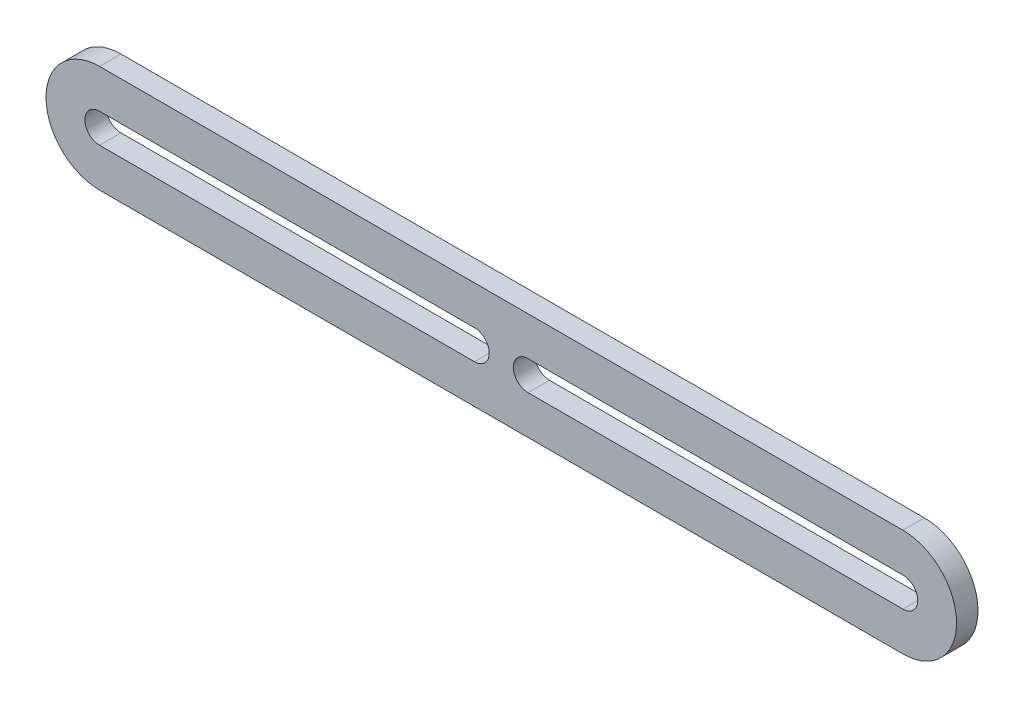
from build123d import *

# Parameters (mm, degrees)
AUFSATZ_LINEAR_AUSTRAGEN1_DEPTH = 4


with BuildPart() as part:
    # Skizze1 → Aufsatz-Linear austragen1 (new body)
    with BuildSketch(Plane.XY):
        with BuildLine():
            Line((0, 20), (150, 20))
            ThreePointArc((150, 20), (160, 10), (150, 0))
            Line((150, 0), (0, 0))
            ThreePointArc((0, 0), (-10, 10), (0, 20))
        make_face()
        with BuildLine():
            Line((0, 12.75), (70, 12.75))
            ThreePointArc((70, 12.75), (72.75, 10), (70, 7.25))
            Line((70, 7.25), (0, 7.25))
            ThreePointArc((0, 7.25), (-2.75, 10), (0, 12.75))
        make_face(mode=Mode.SUBTRACT)
        with BuildLine():
            Line((150, 12.75), (80, 12.75))
            ThreePointArc((80, 12.75), (77.25, 10), (80, 7.25))
            Line((80, 7.25), (150, 7.25))
            ThreePointArc((150, 7.25), (152.75, 10), (150, 12.75))
        make_face(mode=Mode.SUBTRACT)
    extrude(amount=AUFSATZ_LINEAR_AUSTRAGEN1_DEPTH)


solid = part.part
